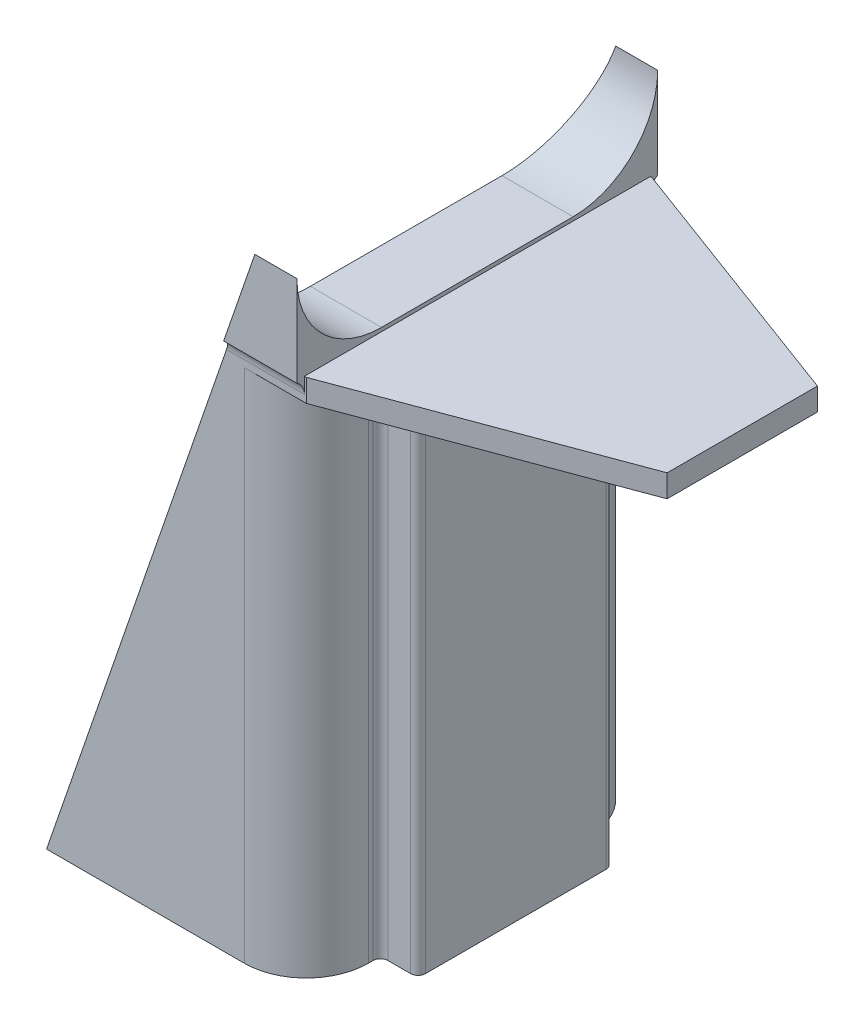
ISO-10303-21;
HEADER;
FILE_DESCRIPTION(('STEP AP214'),'2;1');
FILE_NAME('part.step','',(''),(''),'','','');
FILE_SCHEMA(('AUTOMOTIVE_DESIGN { 1 0 10303 214 1 1 1 1 }'));
ENDSEC;
DATA;
#1=APPLICATION_CONTEXT('core data for automotive mechanical design processes');
#2=APPLICATION_PROTOCOL_DEFINITION('international standard','automotive_design',2000,#1);
#3=PRODUCT_CONTEXT('',#1,'mechanical');
#4=PRODUCT('Part','Part','',(#3));
#5=PRODUCT_RELATED_PRODUCT_CATEGORY('part','',(#4));
#6=PRODUCT_DEFINITION_FORMATION('','',#4);
#7=PRODUCT_DEFINITION_CONTEXT('part definition',#1,'design');
#8=PRODUCT_DEFINITION('design','',#6,#7);
#9=PRODUCT_DEFINITION_SHAPE('','',#8);
#10=(LENGTH_UNIT() NAMED_UNIT(*) SI_UNIT(.MILLI.,.METRE.));
#11=(NAMED_UNIT(*) PLANE_ANGLE_UNIT() SI_UNIT($,.RADIAN.));
#12=(NAMED_UNIT(*) SI_UNIT($,.STERADIAN.) SOLID_ANGLE_UNIT());
#13=UNCERTAINTY_MEASURE_WITH_UNIT(LENGTH_MEASURE(1.E-05),#10,'distance_accuracy_value','');
#14=(GEOMETRIC_REPRESENTATION_CONTEXT(3) GLOBAL_UNCERTAINTY_ASSIGNED_CONTEXT((#13)) GLOBAL_UNIT_ASSIGNED_CONTEXT((#10,
#11,#12)) REPRESENTATION_CONTEXT('',''));
#15=CARTESIAN_POINT('',(0.,0.,0.));
#16=DIRECTION('',(0.,0.,1.));
#17=DIRECTION('',(1.,0.,0.));
#18=AXIS2_PLACEMENT_3D('',#15,#16,#17);
#19=CARTESIAN_POINT('',(0.,60.,-46.0000000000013));
#20=DIRECTION('',(0.,0.,-1.));
#21=DIRECTION('',(-1.,0.,0.));
#22=AXIS2_PLACEMENT_3D('',#19,#20,#21);
#23=PLANE('',#22);
#24=DIRECTION('',(-0.32556815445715,-0.945518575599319,0.));
#25=VECTOR('',#24,1.);
#26=CARTESIAN_POINT('',(30.5350630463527,49.4859346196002,-46.0000000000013));
#27=LINE('',#26,#25);
#28=CARTESIAN_POINT('',(34.7773205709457,61.8063450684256,-46.0000000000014));
#29=VERTEX_POINT('',#28);
#30=CARTESIAN_POINT('',(-13.1073829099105,-77.2609316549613,-46.0000000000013));
#31=VERTEX_POINT('',#30);
#32=EDGE_CURVE('E57',#29,#31,#27,.T.);
#33=ORIENTED_EDGE('',*,*,#32,.F.);
#34=DIRECTION('',(-1.,0.,0.));
#35=VECTOR('',#34,1.);
#36=CARTESIAN_POINT('',(55.4999999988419,61.8063450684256,-46.0000000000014));
#37=LINE('',#36,#35);
#38=CARTESIAN_POINT('',(55.4999999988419,61.8063450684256,-46.0000000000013));
#39=VERTEX_POINT('',#38);
#40=EDGE_CURVE('E336',#39,#29,#37,.T.);
#41=ORIENTED_EDGE('',*,*,#40,.F.);
#42=DIRECTION('',(0.,1.,0.));
#43=VECTOR('',#42,1.);
#44=CARTESIAN_POINT('',(55.4999999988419,61.8063450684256,-46.0000000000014));
#45=LINE('',#44,#43);
#46=CARTESIAN_POINT('',(55.4999999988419,66.,-46.0000000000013));
#47=VERTEX_POINT('',#46);
#48=EDGE_CURVE('E916',#39,#47,#45,.T.);
#49=ORIENTED_EDGE('',*,*,#48,.T.);
#50=DIRECTION('',(-1.,0.,0.));
#51=VECTOR('',#50,1.);
#52=CARTESIAN_POINT('',(0.,66.,-46.0000000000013));
#53=LINE('',#52,#51);
#54=CARTESIAN_POINT('',(55.9999999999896,66.,-46.0000000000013));
#55=VERTEX_POINT('',#54);
#56=EDGE_CURVE('E365',#55,#47,#53,.T.);
#57=ORIENTED_EDGE('',*,*,#56,.F.);
#58=DIRECTION('',(0.,-1.,0.));
#59=VECTOR('',#58,1.);
#60=CARTESIAN_POINT('',(55.9999999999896,66.,-46.0000000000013));
#61=LINE('',#60,#59);
#62=CARTESIAN_POINT('',(55.9999999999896,60.,-46.0000000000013));
#63=VERTEX_POINT('',#62);
#64=EDGE_CURVE('E408',#55,#63,#61,.T.);
#65=ORIENTED_EDGE('',*,*,#64,.T.);
#66=DIRECTION('',(-1.,0.,0.));
#67=VECTOR('',#66,1.);
#68=CARTESIAN_POINT('',(0.,60.,-46.0000000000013));
#69=LINE('',#68,#67);
#70=CARTESIAN_POINT('',(39.5138807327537,60.,-46.0000000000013));
#71=VERTEX_POINT('',#70);
#72=EDGE_CURVE('E385',#63,#71,#69,.T.);
#73=ORIENTED_EDGE('',*,*,#72,.T.);
#74=DIRECTION('',(0.,-1.,0.));
#75=VECTOR('',#74,1.);
#76=CARTESIAN_POINT('',(39.5138807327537,60.,-46.0000000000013));
#77=LINE('',#76,#75);
#78=CARTESIAN_POINT('',(39.5138807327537,-77.2609316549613,-46.0000000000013));
#79=VERTEX_POINT('',#78);
#80=EDGE_CURVE('E544',#71,#79,#77,.T.);
#81=ORIENTED_EDGE('',*,*,#80,.T.);
#82=DIRECTION('',(1.,0.,0.));
#83=VECTOR('',#82,1.);
#84=CARTESIAN_POINT('',(0.,-77.2609316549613,-46.0000000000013));
#85=LINE('',#84,#83);
#86=EDGE_CURVE('E797',#31,#79,#85,.T.);
#87=ORIENTED_EDGE('',*,*,#86,.F.);
#88=EDGE_LOOP('',(#33,#41,#49,#57,#65,#73,#81,#87));
#89=FACE_BOUND('',#88,.T.);
#90=ADVANCED_FACE('F41',(#89),#23,.T.);
#91=CARTESIAN_POINT('',(0.,60.,-40.0000000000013));
#92=DIRECTION('',(0.,0.,-1.));
#93=DIRECTION('',(-1.,0.,0.));
#94=AXIS2_PLACEMENT_3D('',#91,#92,#93);
#95=PLANE('',#94);
#96=DIRECTION('',(1.,0.,0.));
#97=VECTOR('',#96,1.);
#98=CARTESIAN_POINT('',(0.,60.,-40.0000000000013));
#99=LINE('',#98,#97);
#100=CARTESIAN_POINT('',(34.1553460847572,60.,-40.0000000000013));
#101=VERTEX_POINT('',#100);
#102=CARTESIAN_POINT('',(39.5138807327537,60.,-40.0000000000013));
#103=VERTEX_POINT('',#102);
#104=EDGE_CURVE('E431',#101,#103,#99,.T.);
#105=ORIENTED_EDGE('',*,*,#104,.F.);
#106=DIRECTION('',(-0.32556815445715,-0.945518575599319,0.));
#107=VECTOR('',#106,1.);
#108=CARTESIAN_POINT('',(30.5350630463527,49.4859346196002,-40.0000000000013));
#109=LINE('',#108,#107);
#110=CARTESIAN_POINT('',(-13.1073829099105,-77.2609316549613,-40.0000000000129));
#111=VERTEX_POINT('',#110);
#112=EDGE_CURVE('E759',#101,#111,#109,.T.);
#113=ORIENTED_EDGE('',*,*,#112,.T.);
#114=DIRECTION('',(1.,0.,0.));
#115=VECTOR('',#114,1.);
#116=CARTESIAN_POINT('',(0.,-77.2609316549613,-40.0000000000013));
#117=LINE('',#116,#115);
#118=CARTESIAN_POINT('',(39.5138807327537,-77.2609316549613,-40.0000000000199));
#119=VERTEX_POINT('',#118);
#120=EDGE_CURVE('E609',#111,#119,#117,.T.);
#121=ORIENTED_EDGE('',*,*,#120,.T.);
#122=DIRECTION('',(0.,-1.,0.));
#123=VECTOR('',#122,1.);
#124=CARTESIAN_POINT('',(39.5138807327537,60.,-40.0000000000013));
#125=LINE('',#124,#123);
#126=EDGE_CURVE('E540',#103,#119,#125,.T.);
#127=ORIENTED_EDGE('',*,*,#126,.F.);
#128=EDGE_LOOP('',(#105,#113,#121,#127));
#129=FACE_BOUND('',#128,.T.);
#130=ADVANCED_FACE('F723',(#129),#95,.F.);
#131=CARTESIAN_POINT('',(0.,60.,39.9999999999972));
#132=DIRECTION('',(0.,0.,1.));
#133=DIRECTION('',(1.,0.,0.));
#134=AXIS2_PLACEMENT_3D('',#131,#132,#133);
#135=PLANE('',#134);
#136=DIRECTION('',(-1.,0.,0.));
#137=VECTOR('',#136,1.);
#138=CARTESIAN_POINT('',(0.,-77.2609316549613,39.9999999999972));
#139=LINE('',#138,#137);
#140=CARTESIAN_POINT('',(39.4999999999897,-77.2609316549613,40.0000000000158));
#141=VERTEX_POINT('',#140);
#142=CARTESIAN_POINT('',(-13.1073829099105,-77.2609316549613,40.0000000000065));
#143=VERTEX_POINT('',#142);
#144=EDGE_CURVE('E839',#141,#143,#139,.T.);
#145=ORIENTED_EDGE('',*,*,#144,.T.);
#146=DIRECTION('',(0.32556815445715,0.945518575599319,0.));
#147=VECTOR('',#146,1.);
#148=CARTESIAN_POINT('',(30.5350630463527,49.4859346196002,39.9999999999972));
#149=LINE('',#148,#147);
#150=CARTESIAN_POINT('',(34.1553460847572,60.,39.9999999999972));
#151=VERTEX_POINT('',#150);
#152=EDGE_CURVE('E767',#143,#151,#149,.T.);
#153=ORIENTED_EDGE('',*,*,#152,.T.);
#154=DIRECTION('',(-1.,0.,0.));
#155=VECTOR('',#154,1.);
#156=CARTESIAN_POINT('',(0.,60.,39.9999999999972));
#157=LINE('',#156,#155);
#158=CARTESIAN_POINT('',(39.4999999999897,60.,39.9999999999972));
#159=VERTEX_POINT('',#158);
#160=EDGE_CURVE('E456',#159,#151,#157,.T.);
#161=ORIENTED_EDGE('',*,*,#160,.F.);
#162=DIRECTION('',(0.,-1.,0.));
#163=VECTOR('',#162,1.);
#164=CARTESIAN_POINT('',(39.4999999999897,60.,39.9999999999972));
#165=LINE('',#164,#163);
#166=EDGE_CURVE('E512',#159,#141,#165,.T.);
#167=ORIENTED_EDGE('',*,*,#166,.T.);
#168=EDGE_LOOP('',(#145,#153,#161,#167));
#169=FACE_BOUND('',#168,.T.);
#170=ADVANCED_FACE('F719',(#169),#135,.F.);
#171=CARTESIAN_POINT('',(0.,60.,45.9999999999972));
#172=DIRECTION('',(0.,0.,1.));
#173=DIRECTION('',(1.,0.,0.));
#174=AXIS2_PLACEMENT_3D('',#171,#172,#173);
#175=PLANE('',#174);
#176=DIRECTION('',(0.32556815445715,0.945518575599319,0.));
#177=VECTOR('',#176,1.);
#178=CARTESIAN_POINT('',(30.5350630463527,49.4859346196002,45.9999999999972));
#179=LINE('',#178,#177);
#180=CARTESIAN_POINT('',(-13.1073829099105,-77.2609316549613,46.0000000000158));
#181=VERTEX_POINT('',#180);
#182=CARTESIAN_POINT('',(34.7773205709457,61.8063450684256,45.9999999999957));
#183=VERTEX_POINT('',#182);
#184=EDGE_CURVE('E316',#181,#183,#179,.T.);
#185=ORIENTED_EDGE('',*,*,#184,.F.);
#186=DIRECTION('',(-1.,0.,0.));
#187=VECTOR('',#186,1.);
#188=CARTESIAN_POINT('',(-17.6073829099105,-77.2609316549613,45.9999999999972));
#189=LINE('',#188,#187);
#190=CARTESIAN_POINT('',(39.4999999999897,-77.2609316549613,45.9999999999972));
#191=VERTEX_POINT('',#190);
#192=EDGE_CURVE('E778',#191,#181,#189,.T.);
#193=ORIENTED_EDGE('',*,*,#192,.F.);
#194=DIRECTION('',(0.,-1.,0.));
#195=VECTOR('',#194,1.);
#196=CARTESIAN_POINT('',(39.4999999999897,60.,45.9999999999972));
#197=LINE('',#196,#195);
#198=CARTESIAN_POINT('',(39.4999999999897,60.,45.9999999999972));
#199=VERTEX_POINT('',#198);
#200=EDGE_CURVE('E508',#199,#191,#197,.T.);
#201=ORIENTED_EDGE('',*,*,#200,.F.);
#202=DIRECTION('',(1.,0.,0.));
#203=VECTOR('',#202,1.);
#204=CARTESIAN_POINT('',(0.,60.,45.9999999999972));
#205=LINE('',#204,#203);
#206=CARTESIAN_POINT('',(55.9999999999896,60.,45.9999999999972));
#207=VERTEX_POINT('',#206);
#208=EDGE_CURVE('E389',#199,#207,#205,.T.);
#209=ORIENTED_EDGE('',*,*,#208,.T.);
#210=DIRECTION('',(0.,-1.,0.));
#211=VECTOR('',#210,1.);
#212=CARTESIAN_POINT('',(55.9999999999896,66.,45.9999999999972));
#213=LINE('',#212,#211);
#214=CARTESIAN_POINT('',(55.9999999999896,66.,45.9999999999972));
#215=VERTEX_POINT('',#214);
#216=EDGE_CURVE('E404',#215,#207,#213,.T.);
#217=ORIENTED_EDGE('',*,*,#216,.F.);
#218=DIRECTION('',(1.,0.,0.));
#219=VECTOR('',#218,1.);
#220=CARTESIAN_POINT('',(0.,66.,45.9999999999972));
#221=LINE('',#220,#219);
#222=CARTESIAN_POINT('',(55.4999999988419,66.,45.9999999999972));
#223=VERTEX_POINT('',#222);
#224=EDGE_CURVE('E370',#223,#215,#221,.T.);
#225=ORIENTED_EDGE('',*,*,#224,.F.);
#226=DIRECTION('',(0.,-1.,0.));
#227=VECTOR('',#226,1.);
#228=CARTESIAN_POINT('',(55.499999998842,61.8063450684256,45.9999999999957));
#229=LINE('',#228,#227);
#230=CARTESIAN_POINT('',(55.499999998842,61.8063450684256,45.9999999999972));
#231=VERTEX_POINT('',#230);
#232=EDGE_CURVE('E923',#223,#231,#229,.T.);
#233=ORIENTED_EDGE('',*,*,#232,.T.);
#234=DIRECTION('',(-1.,0.,0.));
#235=VECTOR('',#234,1.);
#236=CARTESIAN_POINT('',(55.499999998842,61.8063450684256,45.9999999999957));
#237=LINE('',#236,#235);
#238=EDGE_CURVE('E329',#231,#183,#237,.T.);
#239=ORIENTED_EDGE('',*,*,#238,.T.);
#240=EDGE_LOOP('',(#185,#193,#201,#209,#217,#225,#233,#239));
#241=FACE_BOUND('',#240,.T.);
#242=ADVANCED_FACE('F675',(#241),#175,.T.);
#243=CARTESIAN_POINT('',(0.,66.,0.));
#244=DIRECTION('',(0.,1.,0.));
#245=DIRECTION('',(0.,0.,1.));
#246=AXIS2_PLACEMENT_3D('',#243,#244,#245);
#247=PLANE('',#246);
#248=ORIENTED_EDGE('',*,*,#56,.T.);
#249=DIRECTION('',(0.,0.,1.));
#250=VECTOR('',#249,1.);
#251=CARTESIAN_POINT('',(55.4999999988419,66.,-46.0000000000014));
#252=LINE('',#251,#250);
#253=EDGE_CURVE('E919',#47,#223,#252,.T.);
#254=ORIENTED_EDGE('',*,*,#253,.T.);
#255=ORIENTED_EDGE('',*,*,#224,.T.);
#256=DIRECTION('',(-0.937425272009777,0.,0.348186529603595));
#257=VECTOR('',#256,1.);
#258=CARTESIAN_POINT('',(21.8034433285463,66.,58.7015781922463));
#259=LINE('',#258,#257);
#260=CARTESIAN_POINT('',(125.99999999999,66.,20.));
#261=VERTEX_POINT('',#260);
#262=EDGE_CURVE('E373',#261,#215,#259,.T.);
#263=ORIENTED_EDGE('',*,*,#262,.F.);
#264=DIRECTION('',(0.,0.,1.));
#265=VECTOR('',#264,1.);
#266=CARTESIAN_POINT('',(125.99999999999,66.,0.));
#267=LINE('',#266,#265);
#268=CARTESIAN_POINT('',(125.99999999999,66.,-20.));
#269=VERTEX_POINT('',#268);
#270=EDGE_CURVE('E377',#269,#261,#267,.T.);
#271=ORIENTED_EDGE('',*,*,#270,.F.);
#272=DIRECTION('',(0.93742527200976,0.,0.348186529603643));
#273=VECTOR('',#272,1.);
#274=CARTESIAN_POINT('',(21.8034433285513,66.,-58.7015781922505));
#275=LINE('',#274,#273);
#276=EDGE_CURVE('E361',#55,#269,#275,.T.);
#277=ORIENTED_EDGE('',*,*,#276,.F.);
#278=EDGE_LOOP('',(#248,#254,#255,#263,#271,#277));
#279=FACE_BOUND('',#278,.T.);
#280=ADVANCED_FACE('F672',(#279),#247,.T.);
#281=CARTESIAN_POINT('',(63.9999999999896,60.,-23.730137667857));
#282=DIRECTION('',(0.,-1.,0.));
#283=DIRECTION('',(0.,0.,-1.));
#284=AXIS2_PLACEMENT_3D('',#281,#282,#283);
#285=CYLINDRICAL_SURFACE('',#284,2.);
#286=CARTESIAN_POINT('',(63.9999999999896,-77.2609316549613,-23.730137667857));
#287=DIRECTION('',(0.,1.,0.));
#288=DIRECTION('',(0.,0.,1.));
#289=AXIS2_PLACEMENT_3D('',#286,#287,#288);
#290=CIRCLE('',#289,2.);
#291=CARTESIAN_POINT('',(63.9999999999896,-77.2609316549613,-25.730137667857));
#292=VERTEX_POINT('',#291);
#293=CARTESIAN_POINT('',(65.9999999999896,-77.2609316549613,-23.730137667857));
#294=VERTEX_POINT('',#293);
#295=EDGE_CURVE('E794',#292,#294,#290,.F.);
#296=ORIENTED_EDGE('',*,*,#295,.F.);
#297=DIRECTION('',(0.,-1.,0.));
#298=VECTOR('',#297,1.);
#299=CARTESIAN_POINT('',(63.9999999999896,60.,-25.730137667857));
#300=LINE('',#299,#298);
#301=CARTESIAN_POINT('',(63.9999999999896,60.,-25.730137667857));
#302=VERTEX_POINT('',#301);
#303=EDGE_CURVE('E549',#302,#292,#300,.T.);
#304=ORIENTED_EDGE('',*,*,#303,.F.);
#305=CARTESIAN_POINT('',(63.9999999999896,60.,-23.730137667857));
#306=DIRECTION('',(0.,1.,0.));
#307=DIRECTION('',(0.,0.,1.));
#308=AXIS2_PLACEMENT_3D('',#305,#306,#307);
#309=CIRCLE('',#308,2.);
#310=CARTESIAN_POINT('',(65.9999999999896,60.,-23.730137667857));
#311=VERTEX_POINT('',#310);
#312=EDGE_CURVE('E412',#302,#311,#309,.F.);
#313=ORIENTED_EDGE('',*,*,#312,.T.);
#314=DIRECTION('',(0.,-1.,0.));
#315=VECTOR('',#314,1.);
#316=CARTESIAN_POINT('',(65.9999999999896,60.,-23.730137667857));
#317=LINE('',#316,#315);
#318=EDGE_CURVE('E484',#311,#294,#317,.T.);
#319=ORIENTED_EDGE('',*,*,#318,.T.);
#320=EDGE_LOOP('',(#296,#304,#313,#319));
#321=FACE_BOUND('',#320,.T.);
#322=ADVANCED_FACE('F43',(#321),#285,.T.);
#323=CARTESIAN_POINT('',(0.,60.,-25.730137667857));
#324=DIRECTION('',(0.,0.,-1.));
#325=DIRECTION('',(-1.,0.,0.));
#326=AXIS2_PLACEMENT_3D('',#323,#324,#325);
#327=PLANE('',#326);
#328=DIRECTION('',(1.,0.,0.));
#329=VECTOR('',#328,1.);
#330=CARTESIAN_POINT('',(0.,-77.2609316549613,-25.730137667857));
#331=LINE('',#330,#329);
#332=CARTESIAN_POINT('',(57.9999999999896,-77.2609316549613,-25.730137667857));
#333=VERTEX_POINT('',#332);
#334=EDGE_CURVE('E791',#333,#292,#331,.T.);
#335=ORIENTED_EDGE('',*,*,#334,.F.);
#336=DIRECTION('',(0.,-1.,0.));
#337=VECTOR('',#336,1.);
#338=CARTESIAN_POINT('',(57.9999999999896,60.,-25.730137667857));
#339=LINE('',#338,#337);
#340=CARTESIAN_POINT('',(57.9999999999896,60.,-25.730137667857));
#341=VERTEX_POINT('',#340);
#342=EDGE_CURVE('E545',#341,#333,#339,.T.);
#343=ORIENTED_EDGE('',*,*,#342,.F.);
#344=DIRECTION('',(1.,0.,0.));
#345=VECTOR('',#344,1.);
#346=CARTESIAN_POINT('',(0.,60.,-25.730137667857));
#347=LINE('',#346,#345);
#348=EDGE_CURVE('E416',#341,#302,#347,.T.);
#349=ORIENTED_EDGE('',*,*,#348,.T.);
#350=ORIENTED_EDGE('',*,*,#303,.T.);
#351=EDGE_LOOP('',(#335,#343,#349,#350));
#352=FACE_BOUND('',#351,.T.);
#353=ADVANCED_FACE('F861',(#352),#327,.T.);
#354=CARTESIAN_POINT('',(57.9999999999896,60.,-27.730137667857));
#355=DIRECTION('',(0.,-1.,0.));
#356=DIRECTION('',(0.,0.,-1.));
#357=AXIS2_PLACEMENT_3D('',#354,#355,#356);
#358=CYLINDRICAL_SURFACE('',#357,2.);
#359=ORIENTED_EDGE('',*,*,#342,.T.);
#360=CARTESIAN_POINT('',(57.9999999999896,-77.2609316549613,-27.730137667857));
#361=DIRECTION('',(0.,1.,0.));
#362=DIRECTION('',(0.,0.,1.));
#363=AXIS2_PLACEMENT_3D('',#360,#361,#362);
#364=CIRCLE('',#363,2.);
#365=CARTESIAN_POINT('',(55.9999999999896,-77.2609316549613,-27.730137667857));
#366=VERTEX_POINT('',#365);
#367=EDGE_CURVE('E787',#333,#366,#364,.F.);
#368=ORIENTED_EDGE('',*,*,#367,.T.);
#369=DIRECTION('',(0.,1.,0.));
#370=VECTOR('',#369,1.);
#371=CARTESIAN_POINT('',(55.9999999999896,-106.902939,-27.730137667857));
#372=LINE('',#371,#370);
#373=CARTESIAN_POINT('',(55.9999999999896,0.,-27.730137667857));
#374=VERTEX_POINT('',#373);
#375=EDGE_CURVE('E604',#366,#374,#372,.T.);
#376=ORIENTED_EDGE('',*,*,#375,.T.);
#377=DIRECTION('',(0.,-1.,0.));
#378=VECTOR('',#377,1.);
#379=CARTESIAN_POINT('',(55.9999999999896,60.,-27.730137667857));
#380=LINE('',#379,#378);
#381=CARTESIAN_POINT('',(55.9999999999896,60.,-27.730137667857));
#382=VERTEX_POINT('',#381);
#383=EDGE_CURVE('E550',#382,#374,#380,.T.);
#384=ORIENTED_EDGE('',*,*,#383,.F.);
#385=CARTESIAN_POINT('',(57.9999999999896,60.,-27.730137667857));
#386=DIRECTION('',(0.,1.,0.));
#387=DIRECTION('',(0.,0.,1.));
#388=AXIS2_PLACEMENT_3D('',#385,#386,#387);
#389=CIRCLE('',#388,2.);
#390=EDGE_CURVE('E421',#341,#382,#389,.F.);
#391=ORIENTED_EDGE('',*,*,#390,.F.);
#392=EDGE_LOOP('',(#359,#368,#376,#384,#391));
#393=FACE_BOUND('',#392,.T.);
#394=ADVANCED_FACE('F585',(#393),#358,.F.);
#395=CARTESIAN_POINT('',(55.9999999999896,60.,0.));
#396=DIRECTION('',(1.,0.,0.));
#397=DIRECTION('',(0.,0.,-1.));
#398=AXIS2_PLACEMENT_3D('',#395,#396,#397);
#399=PLANE('',#398);
#400=CARTESIAN_POINT('',(56.0085732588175,0.,-28.8232707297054));
#401=DIRECTION('',(-0.00784259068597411,0.,0.999969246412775));
#402=VECTOR('',#401,1.);
#403=LINE('',#400,#402);
#404=CARTESIAN_POINT('',(56.0042866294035,0.,-28.8233043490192));
#405=VERTEX_POINT('',#404);
#406=EDGE_CURVE('E411',#405,#374,#403,.T.);
#407=ORIENTED_EDGE('',*,*,#406,.F.);
#408=DIRECTION('',(0.,-1.,0.));
#409=VECTOR('',#408,1.);
#410=CARTESIAN_POINT('',(55.9999999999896,60.,-28.8233379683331));
#411=LINE('',#410,#409);
#412=CARTESIAN_POINT('',(55.9999999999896,60.,-28.8233379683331));
#413=VERTEX_POINT('',#412);
#414=EDGE_CURVE('E567',#413,#405,#411,.T.);
#415=ORIENTED_EDGE('',*,*,#414,.F.);
#416=DIRECTION('',(0.,0.,1.));
#417=VECTOR('',#416,1.);
#418=CARTESIAN_POINT('',(55.9999999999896,60.,0.));
#419=LINE('',#418,#417);
#420=EDGE_CURVE('E424',#413,#382,#419,.T.);
#421=ORIENTED_EDGE('',*,*,#420,.T.);
#422=ORIENTED_EDGE('',*,*,#383,.T.);
#423=EDGE_LOOP('',(#407,#415,#421,#422));
#424=FACE_BOUND('',#423,.T.);
#425=ADVANCED_FACE('F580',(#424),#399,.T.);
#426=CARTESIAN_POINT('',(39.5138807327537,60.,-29.5000000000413));
#427=DIRECTION('',(0.,-1.,0.));
#428=DIRECTION('',(0.,0.,-1.));
#429=AXIS2_PLACEMENT_3D('',#426,#427,#428);
#430=CYLINDRICAL_SURFACE('',#429,16.4999999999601);
#431=DIRECTION('',(0.,1.,0.));
#432=VECTOR('',#431,1.);
#433=CARTESIAN_POINT('',(56.0138807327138,-106.902939,-29.5000000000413));
#434=LINE('',#433,#432);
#435=CARTESIAN_POINT('',(56.0138807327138,-77.2609316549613,-29.5000000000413));
#436=VERTEX_POINT('',#435);
#437=CARTESIAN_POINT('',(56.0141086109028,0.,-29.4999994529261));
#438=VERTEX_POINT('',#437);
#439=EDGE_CURVE('E608',#436,#438,#434,.T.);
#440=ORIENTED_EDGE('',*,*,#439,.F.);
#441=CARTESIAN_POINT('',(39.5138807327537,-77.2609316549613,-29.5000000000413));
#442=DIRECTION('',(0.,1.,0.));
#443=DIRECTION('',(0.,0.,1.));
#444=AXIS2_PLACEMENT_3D('',#441,#442,#443);
#445=CIRCLE('',#444,16.4999999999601);
#446=EDGE_CURVE('E65',#436,#79,#445,.T.);
#447=ORIENTED_EDGE('',*,*,#446,.T.);
#448=ORIENTED_EDGE('',*,*,#80,.F.);
#449=CARTESIAN_POINT('',(39.5138807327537,60.,-29.5000000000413));
#450=DIRECTION('',(0.,1.,0.));
#451=DIRECTION('',(0.,0.,1.));
#452=AXIS2_PLACEMENT_3D('',#449,#450,#451);
#453=CIRCLE('',#452,16.4999999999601);
#454=EDGE_CURVE('E428',#413,#71,#453,.T.);
#455=ORIENTED_EDGE('',*,*,#454,.F.);
#456=ORIENTED_EDGE('',*,*,#414,.T.);
#457=CARTESIAN_POINT('',(39.5138807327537,0.,-29.5000000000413));
#458=DIRECTION('',(0.,1.,0.));
#459=DIRECTION('',(0.999158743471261,0.,0.0410098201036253));
#460=AXIS2_PLACEMENT_3D('',#457,#458,#459);
#461=CIRCLE('',#460,16.4999999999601);
#462=EDGE_CURVE('E417',#405,#438,#461,.T.);
#463=ORIENTED_EDGE('',*,*,#462,.T.);
#464=EDGE_LOOP('',(#440,#447,#448,#455,#456,#463));
#465=FACE_BOUND('',#464,.T.);
#466=ADVANCED_FACE('F569',(#465),#430,.T.);
#467=CARTESIAN_POINT('',(39.5138807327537,60.,-29.5000000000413));
#468=DIRECTION('',(0.,-1.,0.));
#469=DIRECTION('',(0.,0.,-1.));
#470=AXIS2_PLACEMENT_3D('',#467,#468,#469);
#471=CYLINDRICAL_SURFACE('',#470,10.4999999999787);
#472=CARTESIAN_POINT('',(39.5138807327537,-77.2609316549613,-29.5000000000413));
#473=DIRECTION('',(0.,1.,0.));
#474=DIRECTION('',(0.,0.,1.));
#475=AXIS2_PLACEMENT_3D('',#472,#473,#474);
#476=CIRCLE('',#475,10.4999999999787);
#477=CARTESIAN_POINT('',(49.9999999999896,-77.2609316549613,-28.9602753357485));
#478=VERTEX_POINT('',#477);
#479=EDGE_CURVE('E835',#478,#119,#476,.T.);
#480=ORIENTED_EDGE('',*,*,#479,.F.);
#481=DIRECTION('',(0.,-1.,0.));
#482=VECTOR('',#481,1.);
#483=CARTESIAN_POINT('',(49.9999999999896,60.,-28.9602753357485));
#484=LINE('',#483,#482);
#485=CARTESIAN_POINT('',(49.9999999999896,60.,-28.9602753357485));
#486=VERTEX_POINT('',#485);
#487=EDGE_CURVE('E536',#486,#478,#484,.T.);
#488=ORIENTED_EDGE('',*,*,#487,.F.);
#489=CARTESIAN_POINT('',(39.5138807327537,60.,-29.5000000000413));
#490=DIRECTION('',(0.,1.,0.));
#491=DIRECTION('',(0.,0.,1.));
#492=AXIS2_PLACEMENT_3D('',#489,#490,#491);
#493=CIRCLE('',#492,10.4999999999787);
#494=EDGE_CURVE('E434',#486,#103,#493,.T.);
#495=ORIENTED_EDGE('',*,*,#494,.T.);
#496=ORIENTED_EDGE('',*,*,#126,.T.);
#497=EDGE_LOOP('',(#480,#488,#495,#496));
#498=FACE_BOUND('',#497,.T.);
#499=ADVANCED_FACE('F579',(#498),#471,.F.);
#500=CARTESIAN_POINT('',(49.9999999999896,60.,0.));
#501=DIRECTION('',(-1.,0.,0.));
#502=DIRECTION('',(0.,0.,1.));
#503=AXIS2_PLACEMENT_3D('',#500,#501,#502);
#504=PLANE('',#503);
#505=DIRECTION('',(0.,0.,-1.));
#506=VECTOR('',#505,1.);
#507=CARTESIAN_POINT('',(49.9999999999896,-77.2609316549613,0.));
#508=LINE('',#507,#506);
#509=CARTESIAN_POINT('',(49.9999999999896,-77.2609316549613,-19.730137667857));
#510=VERTEX_POINT('',#509);
#511=EDGE_CURVE('E832',#510,#478,#508,.T.);
#512=ORIENTED_EDGE('',*,*,#511,.F.);
#513=DIRECTION('',(0.,-1.,0.));
#514=VECTOR('',#513,1.);
#515=CARTESIAN_POINT('',(49.9999999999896,60.,-19.730137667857));
#516=LINE('',#515,#514);
#517=CARTESIAN_POINT('',(49.9999999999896,60.,-19.730137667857));
#518=VERTEX_POINT('',#517);
#519=EDGE_CURVE('E532',#518,#510,#516,.T.);
#520=ORIENTED_EDGE('',*,*,#519,.F.);
#521=DIRECTION('',(0.,0.,-1.));
#522=VECTOR('',#521,1.);
#523=CARTESIAN_POINT('',(49.9999999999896,60.,0.));
#524=LINE('',#523,#522);
#525=EDGE_CURVE('E438',#518,#486,#524,.T.);
#526=ORIENTED_EDGE('',*,*,#525,.T.);
#527=ORIENTED_EDGE('',*,*,#487,.T.);
#528=EDGE_LOOP('',(#512,#520,#526,#527));
#529=FACE_BOUND('',#528,.T.);
#530=ADVANCED_FACE('F743',(#529),#504,.T.);
#531=CARTESIAN_POINT('',(0.,60.,-19.730137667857));
#532=DIRECTION('',(0.,0.,1.));
#533=DIRECTION('',(1.,0.,0.));
#534=AXIS2_PLACEMENT_3D('',#531,#532,#533);
#535=PLANE('',#534);
#536=DIRECTION('',(-1.,0.,0.));
#537=VECTOR('',#536,1.);
#538=CARTESIAN_POINT('',(0.,-77.2609316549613,-19.730137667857));
#539=LINE('',#538,#537);
#540=CARTESIAN_POINT('',(59.9999999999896,-77.2609316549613,-19.730137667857));
#541=VERTEX_POINT('',#540);
#542=EDGE_CURVE('E829',#541,#510,#539,.T.);
#543=ORIENTED_EDGE('',*,*,#542,.F.);
#544=DIRECTION('',(0.,-1.,0.));
#545=VECTOR('',#544,1.);
#546=CARTESIAN_POINT('',(59.9999999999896,60.,-19.730137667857));
#547=LINE('',#546,#545);
#548=CARTESIAN_POINT('',(59.9999999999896,50.,-19.730137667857));
#549=VERTEX_POINT('',#548);
#550=EDGE_CURVE('E528',#549,#541,#547,.T.);
#551=ORIENTED_EDGE('',*,*,#550,.F.);
#552=DIRECTION('',(-1.,0.,0.));
#553=VECTOR('',#552,1.);
#554=CARTESIAN_POINT('',(125.99999999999,50.,-19.730137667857));
#555=LINE('',#554,#553);
#556=CARTESIAN_POINT('',(65.9999999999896,50.,-19.730137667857));
#557=VERTEX_POINT('',#556);
#558=EDGE_CURVE('E345',#557,#549,#555,.T.);
#559=ORIENTED_EDGE('',*,*,#558,.F.);
#560=DIRECTION('',(0.,1.,0.));
#561=VECTOR('',#560,1.);
#562=CARTESIAN_POINT('',(65.9999999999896,60.,-19.730137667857));
#563=LINE('',#562,#561);
#564=CARTESIAN_POINT('',(65.9999999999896,60.,-19.730137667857));
#565=VERTEX_POINT('',#564);
#566=EDGE_CURVE('E356',#557,#565,#563,.T.);
#567=ORIENTED_EDGE('',*,*,#566,.T.);
#568=DIRECTION('',(-1.,0.,0.));
#569=VECTOR('',#568,1.);
#570=CARTESIAN_POINT('',(0.,60.,-19.730137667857));
#571=LINE('',#570,#569);
#572=EDGE_CURVE('E442',#565,#518,#571,.T.);
#573=ORIENTED_EDGE('',*,*,#572,.T.);
#574=ORIENTED_EDGE('',*,*,#519,.T.);
#575=EDGE_LOOP('',(#543,#551,#559,#567,#573,#574));
#576=FACE_BOUND('',#575,.T.);
#577=ADVANCED_FACE('F739',(#576),#535,.T.);
#578=CARTESIAN_POINT('',(59.9999999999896,60.,0.));
#579=DIRECTION('',(-1.,0.,0.));
#580=DIRECTION('',(0.,0.,1.));
#581=AXIS2_PLACEMENT_3D('',#578,#579,#580);
#582=PLANE('',#581);
#583=DIRECTION('',(0.,0.,-1.));
#584=VECTOR('',#583,1.);
#585=CARTESIAN_POINT('',(59.9999999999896,-77.2609316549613,0.));
#586=LINE('',#585,#584);
#587=CARTESIAN_POINT('',(59.9999999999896,-77.2609316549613,20.269862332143));
#588=VERTEX_POINT('',#587);
#589=EDGE_CURVE('E826',#588,#541,#586,.T.);
#590=ORIENTED_EDGE('',*,*,#589,.F.);
#591=DIRECTION('',(0.,-1.,0.));
#592=VECTOR('',#591,1.);
#593=CARTESIAN_POINT('',(59.9999999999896,60.,20.269862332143));
#594=LINE('',#593,#592);
#595=CARTESIAN_POINT('',(59.9999999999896,50.,20.269862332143));
#596=VERTEX_POINT('',#595);
#597=EDGE_CURVE('E524',#596,#588,#594,.T.);
#598=ORIENTED_EDGE('',*,*,#597,.F.);
#599=DIRECTION('',(0.,0.,1.));
#600=VECTOR('',#599,1.);
#601=CARTESIAN_POINT('',(59.9999999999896,50.,-19.730137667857));
#602=LINE('',#601,#600);
#603=EDGE_CURVE('E341',#549,#596,#602,.T.);
#604=ORIENTED_EDGE('',*,*,#603,.F.);
#605=ORIENTED_EDGE('',*,*,#550,.T.);
#606=EDGE_LOOP('',(#590,#598,#604,#605));
#607=FACE_BOUND('',#606,.T.);
#608=ADVANCED_FACE('F735',(#607),#582,.T.);
#609=CARTESIAN_POINT('',(0.,60.,20.269862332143));
#610=DIRECTION('',(0.,0.,-1.));
#611=DIRECTION('',(-1.,0.,0.));
#612=AXIS2_PLACEMENT_3D('',#609,#610,#611);
#613=PLANE('',#612);
#614=DIRECTION('',(1.,0.,0.));
#615=VECTOR('',#614,1.);
#616=CARTESIAN_POINT('',(0.,-77.2609316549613,20.269862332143));
#617=LINE('',#616,#615);
#618=CARTESIAN_POINT('',(49.9999999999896,-77.2609316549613,20.269862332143));
#619=VERTEX_POINT('',#618);
#620=EDGE_CURVE('E823',#619,#588,#617,.T.);
#621=ORIENTED_EDGE('',*,*,#620,.F.);
#622=DIRECTION('',(0.,-1.,0.));
#623=VECTOR('',#622,1.);
#624=CARTESIAN_POINT('',(49.9999999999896,60.,20.269862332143));
#625=LINE('',#624,#623);
#626=CARTESIAN_POINT('',(49.9999999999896,60.,20.269862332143));
#627=VERTEX_POINT('',#626);
#628=EDGE_CURVE('E520',#627,#619,#625,.T.);
#629=ORIENTED_EDGE('',*,*,#628,.F.);
#630=DIRECTION('',(1.,0.,0.));
#631=VECTOR('',#630,1.);
#632=CARTESIAN_POINT('',(0.,60.,20.269862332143));
#633=LINE('',#632,#631);
#634=CARTESIAN_POINT('',(65.9999999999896,60.,20.269862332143));
#635=VERTEX_POINT('',#634);
#636=EDGE_CURVE('E446',#627,#635,#633,.T.);
#637=ORIENTED_EDGE('',*,*,#636,.T.);
#638=DIRECTION('',(0.,-1.,0.));
#639=VECTOR('',#638,1.);
#640=CARTESIAN_POINT('',(65.9999999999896,60.,20.269862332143));
#641=LINE('',#640,#639);
#642=CARTESIAN_POINT('',(65.9999999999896,50.,20.269862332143));
#643=VERTEX_POINT('',#642);
#644=EDGE_CURVE('E350',#635,#643,#641,.T.);
#645=ORIENTED_EDGE('',*,*,#644,.T.);
#646=DIRECTION('',(-1.,0.,0.));
#647=VECTOR('',#646,1.);
#648=CARTESIAN_POINT('',(125.99999999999,50.,20.269862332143));
#649=LINE('',#648,#647);
#650=EDGE_CURVE('E347',#643,#596,#649,.T.);
#651=ORIENTED_EDGE('',*,*,#650,.T.);
#652=ORIENTED_EDGE('',*,*,#597,.T.);
#653=EDGE_LOOP('',(#621,#629,#637,#645,#651,#652));
#654=FACE_BOUND('',#653,.T.);
#655=ADVANCED_FACE('F731',(#654),#613,.T.);
#656=CARTESIAN_POINT('',(49.9999999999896,60.,0.));
#657=DIRECTION('',(-1.,0.,0.));
#658=DIRECTION('',(0.,0.,1.));
#659=AXIS2_PLACEMENT_3D('',#656,#657,#658);
#660=PLANE('',#659);
#661=DIRECTION('',(0.,0.,-1.));
#662=VECTOR('',#661,1.);
#663=CARTESIAN_POINT('',(49.9999999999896,-77.2609316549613,0.));
#664=LINE('',#663,#662);
#665=CARTESIAN_POINT('',(49.9999999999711,-77.2609316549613,29.5000000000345));
#666=VERTEX_POINT('',#665);
#667=EDGE_CURVE('E820',#666,#619,#664,.T.);
#668=ORIENTED_EDGE('',*,*,#667,.F.);
#669=DIRECTION('',(0.,-1.,0.));
#670=VECTOR('',#669,1.);
#671=CARTESIAN_POINT('',(49.9999999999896,60.,29.5000000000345));
#672=LINE('',#671,#670);
#673=CARTESIAN_POINT('',(49.9999999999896,60.,29.5000000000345));
#674=VERTEX_POINT('',#673);
#675=EDGE_CURVE('E516',#674,#666,#672,.T.);
#676=ORIENTED_EDGE('',*,*,#675,.F.);
#677=DIRECTION('',(0.,0.,-1.));
#678=VECTOR('',#677,1.);
#679=CARTESIAN_POINT('',(49.9999999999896,60.,0.));
#680=LINE('',#679,#678);
#681=EDGE_CURVE('E449',#674,#627,#680,.T.);
#682=ORIENTED_EDGE('',*,*,#681,.T.);
#683=ORIENTED_EDGE('',*,*,#628,.T.);
#684=EDGE_LOOP('',(#668,#676,#682,#683));
#685=FACE_BOUND('',#684,.T.);
#686=ADVANCED_FACE('F727',(#685),#660,.T.);
#687=CARTESIAN_POINT('',(39.4999999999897,60.,29.5000000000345));
#688=DIRECTION('',(0.,-1.,0.));
#689=DIRECTION('',(0.,0.,-1.));
#690=AXIS2_PLACEMENT_3D('',#687,#688,#689);
#691=CYLINDRICAL_SURFACE('',#690,10.4999999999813);
#692=ORIENTED_EDGE('',*,*,#675,.T.);
#693=CARTESIAN_POINT('',(39.4999999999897,-77.2609316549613,29.5000000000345));
#694=DIRECTION('',(0.,1.,0.));
#695=DIRECTION('',(0.,0.,1.));
#696=AXIS2_PLACEMENT_3D('',#693,#694,#695);
#697=CIRCLE('',#696,10.4999999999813);
#698=EDGE_CURVE('E816',#666,#141,#697,.F.);
#699=ORIENTED_EDGE('',*,*,#698,.T.);
#700=ORIENTED_EDGE('',*,*,#166,.F.);
#701=CARTESIAN_POINT('',(39.4999999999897,60.,29.5000000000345));
#702=DIRECTION('',(0.,1.,0.));
#703=DIRECTION('',(0.,0.,1.));
#704=AXIS2_PLACEMENT_3D('',#701,#702,#703);
#705=CIRCLE('',#704,10.4999999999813);
#706=EDGE_CURVE('E453',#674,#159,#705,.F.);
#707=ORIENTED_EDGE('',*,*,#706,.F.);
#708=EDGE_LOOP('',(#692,#699,#700,#707));
#709=FACE_BOUND('',#708,.T.);
#710=ADVANCED_FACE('F715',(#709),#691,.F.);
#711=CARTESIAN_POINT('',(39.4999999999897,60.,29.5000000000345));
#712=DIRECTION('',(0.,-1.,0.));
#713=DIRECTION('',(0.,0.,-1.));
#714=AXIS2_PLACEMENT_3D('',#711,#712,#713);
#715=CYLINDRICAL_SURFACE('',#714,16.4999999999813);
#716=ORIENTED_EDGE('',*,*,#200,.T.);
#717=CARTESIAN_POINT('',(39.4999999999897,-77.2609316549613,29.5000000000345));
#718=DIRECTION('',(0.,1.,0.));
#719=DIRECTION('',(0.,0.,1.));
#720=AXIS2_PLACEMENT_3D('',#717,#718,#719);
#721=CIRCLE('',#720,16.4999999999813);
#722=CARTESIAN_POINT('',(55.9999999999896,-77.2609316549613,29.5000000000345));
#723=VERTEX_POINT('',#722);
#724=EDGE_CURVE('E812',#191,#723,#721,.T.);
#725=ORIENTED_EDGE('',*,*,#724,.T.);
#726=DIRECTION('',(0.,-1.,0.));
#727=VECTOR('',#726,1.);
#728=CARTESIAN_POINT('',(55.9999999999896,60.,29.5000000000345));
#729=LINE('',#728,#727);
#730=CARTESIAN_POINT('',(55.9999999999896,60.,29.5000000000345));
#731=VERTEX_POINT('',#730);
#732=EDGE_CURVE('E504',#731,#723,#729,.T.);
#733=ORIENTED_EDGE('',*,*,#732,.F.);
#734=CARTESIAN_POINT('',(39.4999999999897,60.,29.5000000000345));
#735=DIRECTION('',(0.,1.,0.));
#736=DIRECTION('',(0.,0.,1.));
#737=AXIS2_PLACEMENT_3D('',#734,#735,#736);
#738=CIRCLE('',#737,16.4999999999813);
#739=EDGE_CURVE('E460',#199,#731,#738,.T.);
#740=ORIENTED_EDGE('',*,*,#739,.F.);
#741=EDGE_LOOP('',(#716,#725,#733,#740));
#742=FACE_BOUND('',#741,.T.);
#743=ADVANCED_FACE('F711',(#742),#715,.T.);
#744=CARTESIAN_POINT('',(55.9999999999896,60.,0.));
#745=DIRECTION('',(1.,0.,0.));
#746=DIRECTION('',(0.,0.,-1.));
#747=AXIS2_PLACEMENT_3D('',#744,#745,#746);
#748=PLANE('',#747);
#749=DIRECTION('',(0.,0.,1.));
#750=VECTOR('',#749,1.);
#751=CARTESIAN_POINT('',(55.9999999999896,-77.2609316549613,0.));
#752=LINE('',#751,#750);
#753=CARTESIAN_POINT('',(55.9999999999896,-77.2609316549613,28.269862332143));
#754=VERTEX_POINT('',#753);
#755=EDGE_CURVE('E809',#754,#723,#752,.T.);
#756=ORIENTED_EDGE('',*,*,#755,.F.);
#757=DIRECTION('',(0.,-1.,0.));
#758=VECTOR('',#757,1.);
#759=CARTESIAN_POINT('',(55.9999999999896,60.,28.269862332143));
#760=LINE('',#759,#758);
#761=CARTESIAN_POINT('',(55.9999999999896,60.,28.269862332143));
#762=VERTEX_POINT('',#761);
#763=EDGE_CURVE('E500',#762,#754,#760,.T.);
#764=ORIENTED_EDGE('',*,*,#763,.F.);
#765=DIRECTION('',(0.,0.,1.));
#766=VECTOR('',#765,1.);
#767=CARTESIAN_POINT('',(55.9999999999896,60.,0.));
#768=LINE('',#767,#766);
#769=EDGE_CURVE('E463',#762,#731,#768,.T.);
#770=ORIENTED_EDGE('',*,*,#769,.T.);
#771=ORIENTED_EDGE('',*,*,#732,.T.);
#772=EDGE_LOOP('',(#756,#764,#770,#771));
#773=FACE_BOUND('',#772,.T.);
#774=ADVANCED_FACE('F707',(#773),#748,.T.);
#775=CARTESIAN_POINT('',(57.9999999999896,60.,28.269862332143));
#776=DIRECTION('',(0.,-1.,0.));
#777=DIRECTION('',(0.,0.,-1.));
#778=AXIS2_PLACEMENT_3D('',#775,#776,#777);
#779=CYLINDRICAL_SURFACE('',#778,2.);
#780=CARTESIAN_POINT('',(57.9999999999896,-77.2609316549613,28.269862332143));
#781=DIRECTION('',(0.,1.,0.));
#782=DIRECTION('',(0.,0.,1.));
#783=AXIS2_PLACEMENT_3D('',#780,#781,#782);
#784=CIRCLE('',#783,2.);
#785=CARTESIAN_POINT('',(57.9999999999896,-77.2609316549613,26.269862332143));
#786=VERTEX_POINT('',#785);
#787=EDGE_CURVE('E806',#786,#754,#784,.T.);
#788=ORIENTED_EDGE('',*,*,#787,.F.);
#789=DIRECTION('',(0.,-1.,0.));
#790=VECTOR('',#789,1.);
#791=CARTESIAN_POINT('',(57.9999999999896,60.,26.269862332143));
#792=LINE('',#791,#790);
#793=CARTESIAN_POINT('',(57.9999999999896,60.,26.269862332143));
#794=VERTEX_POINT('',#793);
#795=EDGE_CURVE('E496',#794,#786,#792,.T.);
#796=ORIENTED_EDGE('',*,*,#795,.F.);
#797=CARTESIAN_POINT('',(57.9999999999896,60.,28.269862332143));
#798=DIRECTION('',(0.,1.,0.));
#799=DIRECTION('',(0.,0.,1.));
#800=AXIS2_PLACEMENT_3D('',#797,#798,#799);
#801=CIRCLE('',#800,2.);
#802=EDGE_CURVE('E467',#794,#762,#801,.T.);
#803=ORIENTED_EDGE('',*,*,#802,.T.);
#804=ORIENTED_EDGE('',*,*,#763,.T.);
#805=EDGE_LOOP('',(#788,#796,#803,#804));
#806=FACE_BOUND('',#805,.T.);
#807=ADVANCED_FACE('F703',(#806),#779,.F.);
#808=CARTESIAN_POINT('',(0.,60.,26.269862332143));
#809=DIRECTION('',(0.,0.,1.));
#810=DIRECTION('',(1.,0.,0.));
#811=AXIS2_PLACEMENT_3D('',#808,#809,#810);
#812=PLANE('',#811);
#813=DIRECTION('',(-1.,0.,0.));
#814=VECTOR('',#813,1.);
#815=CARTESIAN_POINT('',(0.,-77.2609316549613,26.269862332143));
#816=LINE('',#815,#814);
#817=CARTESIAN_POINT('',(63.9999999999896,-77.2609316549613,26.269862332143));
#818=VERTEX_POINT('',#817);
#819=EDGE_CURVE('E803',#818,#786,#816,.T.);
#820=ORIENTED_EDGE('',*,*,#819,.F.);
#821=DIRECTION('',(0.,-1.,0.));
#822=VECTOR('',#821,1.);
#823=CARTESIAN_POINT('',(63.9999999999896,60.,26.269862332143));
#824=LINE('',#823,#822);
#825=CARTESIAN_POINT('',(63.9999999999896,60.,26.269862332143));
#826=VERTEX_POINT('',#825);
#827=EDGE_CURVE('E492',#826,#818,#824,.T.);
#828=ORIENTED_EDGE('',*,*,#827,.F.);
#829=DIRECTION('',(-1.,0.,0.));
#830=VECTOR('',#829,1.);
#831=CARTESIAN_POINT('',(0.,60.,26.269862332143));
#832=LINE('',#831,#830);
#833=EDGE_CURVE('E471',#826,#794,#832,.T.);
#834=ORIENTED_EDGE('',*,*,#833,.T.);
#835=ORIENTED_EDGE('',*,*,#795,.T.);
#836=EDGE_LOOP('',(#820,#828,#834,#835));
#837=FACE_BOUND('',#836,.T.);
#838=ADVANCED_FACE('F699',(#837),#812,.T.);
#839=CARTESIAN_POINT('',(63.9999999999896,60.,24.269862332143));
#840=DIRECTION('',(0.,-1.,0.));
#841=DIRECTION('',(0.,0.,-1.));
#842=AXIS2_PLACEMENT_3D('',#839,#840,#841);
#843=CYLINDRICAL_SURFACE('',#842,2.);
#844=CARTESIAN_POINT('',(63.9999999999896,-77.2609316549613,24.269862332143));
#845=DIRECTION('',(0.,1.,0.));
#846=DIRECTION('',(0.,0.,1.));
#847=AXIS2_PLACEMENT_3D('',#844,#845,#846);
#848=CIRCLE('',#847,2.);
#849=CARTESIAN_POINT('',(65.9999999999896,-77.2609316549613,24.269862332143));
#850=VERTEX_POINT('',#849);
#851=EDGE_CURVE('E800',#850,#818,#848,.F.);
#852=ORIENTED_EDGE('',*,*,#851,.F.);
#853=DIRECTION('',(0.,-1.,0.));
#854=VECTOR('',#853,1.);
#855=CARTESIAN_POINT('',(65.9999999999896,60.,24.269862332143));
#856=LINE('',#855,#854);
#857=CARTESIAN_POINT('',(65.9999999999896,60.,24.269862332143));
#858=VERTEX_POINT('',#857);
#859=EDGE_CURVE('E488',#858,#850,#856,.T.);
#860=ORIENTED_EDGE('',*,*,#859,.F.);
#861=CARTESIAN_POINT('',(63.9999999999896,60.,24.269862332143));
#862=DIRECTION('',(0.,1.,0.));
#863=DIRECTION('',(0.,0.,1.));
#864=AXIS2_PLACEMENT_3D('',#861,#862,#863);
#865=CIRCLE('',#864,2.);
#866=EDGE_CURVE('E475',#858,#826,#865,.F.);
#867=ORIENTED_EDGE('',*,*,#866,.T.);
#868=ORIENTED_EDGE('',*,*,#827,.T.);
#869=EDGE_LOOP('',(#852,#860,#867,#868));
#870=FACE_BOUND('',#869,.T.);
#871=ADVANCED_FACE('F695',(#870),#843,.T.);
#872=CARTESIAN_POINT('',(65.9999999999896,60.,0.));
#873=DIRECTION('',(1.,0.,0.));
#874=DIRECTION('',(0.,0.,-1.));
#875=AXIS2_PLACEMENT_3D('',#872,#873,#874);
#876=PLANE('',#875);
#877=DIRECTION('',(0.,0.,1.));
#878=VECTOR('',#877,1.);
#879=CARTESIAN_POINT('',(65.9999999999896,-77.2609316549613,-48.0000000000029));
#880=LINE('',#879,#878);
#881=EDGE_CURVE('E782',#294,#850,#880,.T.);
#882=ORIENTED_EDGE('',*,*,#881,.F.);
#883=ORIENTED_EDGE('',*,*,#318,.F.);
#884=DIRECTION('',(0.,0.,1.));
#885=VECTOR('',#884,1.);
#886=CARTESIAN_POINT('',(65.9999999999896,60.,0.));
#887=LINE('',#886,#885);
#888=EDGE_CURVE('E480',#311,#565,#887,.T.);
#889=ORIENTED_EDGE('',*,*,#888,.T.);
#890=ORIENTED_EDGE('',*,*,#566,.F.);
#891=DIRECTION('',(0.,0.,-1.));
#892=VECTOR('',#891,1.);
#893=CARTESIAN_POINT('',(65.9999999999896,50.,0.));
#894=LINE('',#893,#892);
#895=EDGE_CURVE('E554',#643,#557,#894,.T.);
#896=ORIENTED_EDGE('',*,*,#895,.F.);
#897=ORIENTED_EDGE('',*,*,#644,.F.);
#898=EDGE_CURVE('E479',#635,#858,#887,.T.);
#899=ORIENTED_EDGE('',*,*,#898,.T.);
#900=ORIENTED_EDGE('',*,*,#859,.T.);
#901=EDGE_LOOP('',(#882,#883,#889,#890,#896,#897,#899,#900));
#902=FACE_BOUND('',#901,.T.);
#903=ADVANCED_FACE('F681',(#902),#876,.T.);
#904=CARTESIAN_POINT('',(0.,60.,0.));
#905=DIRECTION('',(0.,1.,0.));
#906=DIRECTION('',(0.,0.,1.));
#907=AXIS2_PLACEMENT_3D('',#904,#905,#906);
#908=PLANE('',#907);
#909=ORIENTED_EDGE('',*,*,#160,.T.);
#910=DIRECTION('',(0.,0.,-1.));
#911=VECTOR('',#910,1.);
#912=CARTESIAN_POINT('',(34.1553460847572,60.,0.));
#913=LINE('',#912,#911);
#914=EDGE_CURVE('E763',#151,#101,#913,.T.);
#915=ORIENTED_EDGE('',*,*,#914,.T.);
#916=ORIENTED_EDGE('',*,*,#104,.T.);
#917=ORIENTED_EDGE('',*,*,#494,.F.);
#918=ORIENTED_EDGE('',*,*,#525,.F.);
#919=ORIENTED_EDGE('',*,*,#572,.F.);
#920=ORIENTED_EDGE('',*,*,#888,.F.);
#921=ORIENTED_EDGE('',*,*,#312,.F.);
#922=ORIENTED_EDGE('',*,*,#348,.F.);
#923=ORIENTED_EDGE('',*,*,#390,.T.);
#924=ORIENTED_EDGE('',*,*,#420,.F.);
#925=ORIENTED_EDGE('',*,*,#454,.T.);
#926=ORIENTED_EDGE('',*,*,#72,.F.);
#927=DIRECTION('',(0.93742527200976,0.,0.348186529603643));
#928=VECTOR('',#927,1.);
#929=CARTESIAN_POINT('',(21.8034433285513,60.,-58.7015781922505));
#930=LINE('',#929,#928);
#931=CARTESIAN_POINT('',(125.99999999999,60.,-20.));
#932=VERTEX_POINT('',#931);
#933=EDGE_CURVE('E360',#63,#932,#930,.T.);
#934=ORIENTED_EDGE('',*,*,#933,.T.);
#935=DIRECTION('',(0.,0.,1.));
#936=VECTOR('',#935,1.);
#937=CARTESIAN_POINT('',(125.99999999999,60.,0.));
#938=LINE('',#937,#936);
#939=CARTESIAN_POINT('',(125.99999999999,60.,20.));
#940=VERTEX_POINT('',#939);
#941=EDGE_CURVE('E366',#932,#940,#938,.T.);
#942=ORIENTED_EDGE('',*,*,#941,.T.);
#943=DIRECTION('',(-0.937425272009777,0.,0.348186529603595));
#944=VECTOR('',#943,1.);
#945=CARTESIAN_POINT('',(21.8034433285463,60.,58.7015781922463));
#946=LINE('',#945,#944);
#947=EDGE_CURVE('E393',#940,#207,#946,.T.);
#948=ORIENTED_EDGE('',*,*,#947,.T.);
#949=ORIENTED_EDGE('',*,*,#208,.F.);
#950=ORIENTED_EDGE('',*,*,#739,.T.);
#951=ORIENTED_EDGE('',*,*,#769,.F.);
#952=ORIENTED_EDGE('',*,*,#802,.F.);
#953=ORIENTED_EDGE('',*,*,#833,.F.);
#954=ORIENTED_EDGE('',*,*,#866,.F.);
#955=ORIENTED_EDGE('',*,*,#898,.F.);
#956=ORIENTED_EDGE('',*,*,#636,.F.);
#957=ORIENTED_EDGE('',*,*,#681,.F.);
#958=ORIENTED_EDGE('',*,*,#706,.T.);
#959=EDGE_LOOP('',(#909,#915,#916,#917,#918,#919,#920,#921,#922,#923,#924,#925,#926,#934,#942,
#948,#949,#950,#951,#952,#953,#954,#955,#956,#957,#958));
#960=FACE_BOUND('',#959,.T.);
#961=ADVANCED_FACE('F677',(#960),#908,.F.);
#962=CARTESIAN_POINT('',(21.8034433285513,66.,-58.7015781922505));
#963=DIRECTION('',(0.348186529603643,0.,-0.93742527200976));
#964=DIRECTION('',(-0.93742527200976,0.,-0.348186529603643));
#965=AXIS2_PLACEMENT_3D('',#962,#963,#964);
#966=PLANE('',#965);
#967=ORIENTED_EDGE('',*,*,#933,.F.);
#968=ORIENTED_EDGE('',*,*,#64,.F.);
#969=ORIENTED_EDGE('',*,*,#276,.T.);
#970=DIRECTION('',(0.,-1.,0.));
#971=VECTOR('',#970,1.);
#972=CARTESIAN_POINT('',(125.99999999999,66.,-20.));
#973=LINE('',#972,#971);
#974=EDGE_CURVE('E381',#269,#932,#973,.T.);
#975=ORIENTED_EDGE('',*,*,#974,.T.);
#976=EDGE_LOOP('',(#967,#968,#969,#975));
#977=FACE_BOUND('',#976,.T.);
#978=ADVANCED_FACE('F680',(#977),#966,.T.);
#979=CARTESIAN_POINT('',(21.8034433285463,66.,58.7015781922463));
#980=DIRECTION('',(0.348186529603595,0.,0.937425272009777));
#981=DIRECTION('',(0.937425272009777,0.,-0.348186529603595));
#982=AXIS2_PLACEMENT_3D('',#979,#980,#981);
#983=PLANE('',#982);
#984=ORIENTED_EDGE('',*,*,#947,.F.);
#985=DIRECTION('',(0.,-1.,0.));
#986=VECTOR('',#985,1.);
#987=CARTESIAN_POINT('',(125.99999999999,66.,20.));
#988=LINE('',#987,#986);
#989=EDGE_CURVE('E400',#261,#940,#988,.T.);
#990=ORIENTED_EDGE('',*,*,#989,.F.);
#991=ORIENTED_EDGE('',*,*,#262,.T.);
#992=ORIENTED_EDGE('',*,*,#216,.T.);
#993=EDGE_LOOP('',(#984,#990,#991,#992));
#994=FACE_BOUND('',#993,.T.);
#995=ADVANCED_FACE('F685',(#994),#983,.T.);
#996=CARTESIAN_POINT('',(125.99999999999,66.,0.));
#997=DIRECTION('',(1.,0.,0.));
#998=DIRECTION('',(0.,0.,-1.));
#999=AXIS2_PLACEMENT_3D('',#996,#997,#998);
#1000=PLANE('',#999);
#1001=ORIENTED_EDGE('',*,*,#941,.F.);
#1002=ORIENTED_EDGE('',*,*,#974,.F.);
#1003=ORIENTED_EDGE('',*,*,#270,.T.);
#1004=ORIENTED_EDGE('',*,*,#989,.T.);
#1005=EDGE_LOOP('',(#1001,#1002,#1003,#1004));
#1006=FACE_BOUND('',#1005,.T.);
#1007=ADVANCED_FACE('F670',(#1006),#1000,.T.);
#1008=CARTESIAN_POINT('',(125.99999999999,50.,-19.730137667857));
#1009=DIRECTION('',(0.,-1.,0.));
#1010=DIRECTION('',(0.,0.,-1.));
#1011=AXIS2_PLACEMENT_3D('',#1008,#1009,#1010);
#1012=PLANE('',#1011);
#1013=ORIENTED_EDGE('',*,*,#895,.T.);
#1014=ORIENTED_EDGE('',*,*,#558,.T.);
#1015=ORIENTED_EDGE('',*,*,#603,.T.);
#1016=ORIENTED_EDGE('',*,*,#650,.F.);
#1017=EDGE_LOOP('',(#1013,#1014,#1015,#1016));
#1018=FACE_BOUND('',#1017,.T.);
#1019=ADVANCED_FACE('F666',(#1018),#1012,.F.);
#1020=CARTESIAN_POINT('',(55.4999999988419,61.8063450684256,-50.1936549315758));
#1021=DIRECTION('',(-1.,0.,0.));
#1022=DIRECTION('',(0.,0.,1.));
#1023=AXIS2_PLACEMENT_3D('',#1020,#1021,#1022);
#1024=CYLINDRICAL_SURFACE('',#1023,4.19365493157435);
#1025=CARTESIAN_POINT('',(34.7773205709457,61.8063450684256,-50.1936549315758));
#1026=DIRECTION('',(0.945518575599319,-0.32556815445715,0.));
#1027=DIRECTION('',(-0.32556815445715,-0.945518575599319,0.));
#1028=AXIS2_PLACEMENT_3D('',#1025,#1026,#1027);
#1029=ELLIPSE('',#1028,4.43529618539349,4.19365493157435);
#1030=CARTESIAN_POINT('',(36.0080025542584,65.3805050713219,-48.0000000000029));
#1031=VERTEX_POINT('',#1030);
#1032=EDGE_CURVE('E772',#1031,#29,#1029,.T.);
#1033=ORIENTED_EDGE('',*,*,#1032,.F.);
#1034=DIRECTION('',(-1.,0.,0.));
#1035=VECTOR('',#1034,1.);
#1036=CARTESIAN_POINT('',(55.4999999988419,65.3805050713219,-48.0000000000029));
#1037=LINE('',#1036,#1035);
#1038=CARTESIAN_POINT('',(55.4999999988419,65.3805050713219,-48.0000000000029));
#1039=VERTEX_POINT('',#1038);
#1040=EDGE_CURVE('E346',#1039,#1031,#1037,.T.);
#1041=ORIENTED_EDGE('',*,*,#1040,.F.);
#1042=CARTESIAN_POINT('',(55.4999999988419,61.8063450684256,-50.1936549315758));
#1043=DIRECTION('',(1.,0.,0.));
#1044=DIRECTION('',(0.,0.,1.));
#1045=AXIS2_PLACEMENT_3D('',#1042,#1043,#1044);
#1046=CIRCLE('',#1045,4.19365493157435);
#1047=EDGE_CURVE('E619',#1039,#39,#1046,.T.);
#1048=ORIENTED_EDGE('',*,*,#1047,.T.);
#1049=ORIENTED_EDGE('',*,*,#40,.T.);
#1050=EDGE_LOOP('',(#1033,#1041,#1048,#1049));
#1051=FACE_BOUND('',#1050,.T.);
#1052=ADVANCED_FACE('F648',(#1051),#1024,.F.);
#1053=CARTESIAN_POINT('',(55.4999999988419,65.3805050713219,-48.0000000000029));
#1054=DIRECTION('',(0.,0.,-1.));
#1055=DIRECTION('',(-1.,0.,0.));
#1056=AXIS2_PLACEMENT_3D('',#1053,#1054,#1055);
#1057=PLANE('',#1056);
#1058=DIRECTION('',(0.32556815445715,0.945518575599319,0.));
#1059=VECTOR('',#1058,1.);
#1060=CARTESIAN_POINT('',(-13.1073829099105,-77.2609316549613,-48.0000000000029));
#1061=LINE('',#1060,#1059);
#1062=CARTESIAN_POINT('',(44.3130106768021,89.5,-48.0000000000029));
#1063=VERTEX_POINT('',#1062);
#1064=EDGE_CURVE('E305',#1031,#1063,#1061,.T.);
#1065=ORIENTED_EDGE('',*,*,#1064,.T.);
#1066=DIRECTION('',(-1.,0.,0.));
#1067=VECTOR('',#1066,1.);
#1068=CARTESIAN_POINT('',(55.4999999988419,89.5,-48.0000000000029));
#1069=LINE('',#1068,#1067);
#1070=CARTESIAN_POINT('',(55.4999999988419,89.5,-48.0000000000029));
#1071=VERTEX_POINT('',#1070);
#1072=EDGE_CURVE('E949',#1071,#1063,#1069,.T.);
#1073=ORIENTED_EDGE('',*,*,#1072,.F.);
#1074=DIRECTION('',(0.,-1.,0.));
#1075=VECTOR('',#1074,1.);
#1076=CARTESIAN_POINT('',(55.4999999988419,65.3805050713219,-48.0000000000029));
#1077=LINE('',#1076,#1075);
#1078=EDGE_CURVE('E340',#1071,#1039,#1077,.T.);
#1079=ORIENTED_EDGE('',*,*,#1078,.T.);
#1080=ORIENTED_EDGE('',*,*,#1040,.T.);
#1081=EDGE_LOOP('',(#1065,#1073,#1079,#1080));
#1082=FACE_BOUND('',#1081,.T.);
#1083=ADVANCED_FACE('F644',(#1082),#1057,.T.);
#1084=CARTESIAN_POINT('',(55.4999999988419,89.5,-25.5000000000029));
#1085=DIRECTION('',(-1.,0.,0.));
#1086=DIRECTION('',(0.,0.,1.));
#1087=AXIS2_PLACEMENT_3D('',#1084,#1085,#1086);
#1088=CYLINDRICAL_SURFACE('',#1087,22.5);
#1089=CARTESIAN_POINT('',(44.3130106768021,89.5,-25.5000000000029));
#1090=DIRECTION('',(0.945518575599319,-0.32556815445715,0.));
#1091=DIRECTION('',(-0.32556815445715,-0.945518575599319,0.));
#1092=AXIS2_PLACEMENT_3D('',#1089,#1090,#1091);
#1093=ELLIPSE('',#1092,23.7964653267,22.5);
#1094=CARTESIAN_POINT('',(36.5656393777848,67.,-25.5000000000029));
#1095=VERTEX_POINT('',#1094);
#1096=EDGE_CURVE('E904',#1095,#1063,#1093,.T.);
#1097=ORIENTED_EDGE('',*,*,#1096,.F.);
#1098=DIRECTION('',(-1.,0.,0.));
#1099=VECTOR('',#1098,1.);
#1100=CARTESIAN_POINT('',(55.4999999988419,67.,-25.5000000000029));
#1101=LINE('',#1100,#1099);
#1102=CARTESIAN_POINT('',(55.4999999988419,67.,-25.5000000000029));
#1103=VERTEX_POINT('',#1102);
#1104=EDGE_CURVE('E327',#1103,#1095,#1101,.T.);
#1105=ORIENTED_EDGE('',*,*,#1104,.F.);
#1106=CARTESIAN_POINT('',(55.4999999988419,89.5,-25.5000000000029));
#1107=DIRECTION('',(1.,0.,0.));
#1108=DIRECTION('',(0.,0.,1.));
#1109=AXIS2_PLACEMENT_3D('',#1106,#1107,#1108);
#1110=CIRCLE('',#1109,22.5);
#1111=EDGE_CURVE('E941',#1103,#1071,#1110,.T.);
#1112=ORIENTED_EDGE('',*,*,#1111,.T.);
#1113=ORIENTED_EDGE('',*,*,#1072,.T.);
#1114=EDGE_LOOP('',(#1097,#1105,#1112,#1113));
#1115=FACE_BOUND('',#1114,.T.);
#1116=ADVANCED_FACE('F647',(#1115),#1088,.F.);
#1117=CARTESIAN_POINT('',(55.4999999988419,67.,-25.5000000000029));
#1118=DIRECTION('',(0.,1.,0.));
#1119=DIRECTION('',(0.,0.,1.));
#1120=AXIS2_PLACEMENT_3D('',#1117,#1118,#1119);
#1121=PLANE('',#1120);
#1122=DIRECTION('',(0.,0.,-1.));
#1123=VECTOR('',#1122,1.);
#1124=CARTESIAN_POINT('',(36.5656393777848,67.,-25.5000000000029));
#1125=LINE('',#1124,#1123);
#1126=CARTESIAN_POINT('',(36.5656393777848,67.,25.4999999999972));
#1127=VERTEX_POINT('',#1126);
#1128=EDGE_CURVE('E315',#1127,#1095,#1125,.T.);
#1129=ORIENTED_EDGE('',*,*,#1128,.F.);
#1130=DIRECTION('',(-1.,0.,0.));
#1131=VECTOR('',#1130,1.);
#1132=CARTESIAN_POINT('',(55.499999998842,67.,25.4999999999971));
#1133=LINE('',#1132,#1131);
#1134=CARTESIAN_POINT('',(55.499999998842,67.,25.4999999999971));
#1135=VERTEX_POINT('',#1134);
#1136=EDGE_CURVE('E313',#1135,#1127,#1133,.T.);
#1137=ORIENTED_EDGE('',*,*,#1136,.F.);
#1138=DIRECTION('',(0.,0.,-1.));
#1139=VECTOR('',#1138,1.);
#1140=CARTESIAN_POINT('',(55.4999999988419,67.,-25.5000000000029));
#1141=LINE('',#1140,#1139);
#1142=EDGE_CURVE('E937',#1135,#1103,#1141,.T.);
#1143=ORIENTED_EDGE('',*,*,#1142,.T.);
#1144=ORIENTED_EDGE('',*,*,#1104,.T.);
#1145=EDGE_LOOP('',(#1129,#1137,#1143,#1144));
#1146=FACE_BOUND('',#1145,.T.);
#1147=ADVANCED_FACE('F652',(#1146),#1121,.T.);
#1148=CARTESIAN_POINT('',(55.499999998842,89.5,25.4999999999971));
#1149=DIRECTION('',(-1.,0.,0.));
#1150=DIRECTION('',(0.,0.,1.));
#1151=AXIS2_PLACEMENT_3D('',#1148,#1149,#1150);
#1152=CYLINDRICAL_SURFACE('',#1151,22.5);
#1153=CARTESIAN_POINT('',(44.3130106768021,89.5,25.4999999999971));
#1154=DIRECTION('',(0.945518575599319,-0.32556815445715,0.));
#1155=DIRECTION('',(-0.32556815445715,-0.945518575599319,0.));
#1156=AXIS2_PLACEMENT_3D('',#1153,#1154,#1155);
#1157=ELLIPSE('',#1156,23.7964653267,22.5);
#1158=CARTESIAN_POINT('',(44.3130106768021,89.5,47.9999999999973));
#1159=VERTEX_POINT('',#1158);
#1160=EDGE_CURVE('E297',#1159,#1127,#1157,.T.);
#1161=ORIENTED_EDGE('',*,*,#1160,.F.);
#1162=DIRECTION('',(-1.,0.,0.));
#1163=VECTOR('',#1162,1.);
#1164=CARTESIAN_POINT('',(55.499999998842,89.5,47.9999999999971));
#1165=LINE('',#1164,#1163);
#1166=CARTESIAN_POINT('',(55.499999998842,89.5,47.9999999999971));
#1167=VERTEX_POINT('',#1166);
#1168=EDGE_CURVE('E311',#1167,#1159,#1165,.T.);
#1169=ORIENTED_EDGE('',*,*,#1168,.F.);
#1170=CARTESIAN_POINT('',(55.499999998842,89.5,25.4999999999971));
#1171=DIRECTION('',(1.,0.,0.));
#1172=DIRECTION('',(0.,0.,-1.));
#1173=AXIS2_PLACEMENT_3D('',#1170,#1171,#1172);
#1174=CIRCLE('',#1173,22.5);
#1175=EDGE_CURVE('E934',#1167,#1135,#1174,.T.);
#1176=ORIENTED_EDGE('',*,*,#1175,.T.);
#1177=ORIENTED_EDGE('',*,*,#1136,.T.);
#1178=EDGE_LOOP('',(#1161,#1169,#1176,#1177));
#1179=FACE_BOUND('',#1178,.T.);
#1180=ADVANCED_FACE('F309',(#1179),#1152,.F.);
#1181=CARTESIAN_POINT('',(55.499999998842,65.3805050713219,47.9999999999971));
#1182=DIRECTION('',(0.,0.,1.));
#1183=DIRECTION('',(1.,0.,0.));
#1184=AXIS2_PLACEMENT_3D('',#1181,#1182,#1183);
#1185=PLANE('',#1184);
#1186=DIRECTION('',(0.32556815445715,0.945518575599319,0.));
#1187=VECTOR('',#1186,1.);
#1188=CARTESIAN_POINT('',(-13.1073829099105,-77.2609316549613,47.9999999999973));
#1189=LINE('',#1188,#1187);
#1190=CARTESIAN_POINT('',(36.0080025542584,65.380505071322,47.9999999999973));
#1191=VERTEX_POINT('',#1190);
#1192=EDGE_CURVE('E294',#1191,#1159,#1189,.T.);
#1193=ORIENTED_EDGE('',*,*,#1192,.F.);
#1194=DIRECTION('',(-1.,0.,0.));
#1195=VECTOR('',#1194,1.);
#1196=CARTESIAN_POINT('',(55.499999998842,65.3805050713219,47.9999999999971));
#1197=LINE('',#1196,#1195);
#1198=CARTESIAN_POINT('',(55.499999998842,65.3805050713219,47.9999999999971));
#1199=VERTEX_POINT('',#1198);
#1200=EDGE_CURVE('E323',#1199,#1191,#1197,.T.);
#1201=ORIENTED_EDGE('',*,*,#1200,.F.);
#1202=DIRECTION('',(0.,1.,0.));
#1203=VECTOR('',#1202,1.);
#1204=CARTESIAN_POINT('',(55.499999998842,65.3805050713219,47.9999999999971));
#1205=LINE('',#1204,#1203);
#1206=EDGE_CURVE('E321',#1199,#1167,#1205,.T.);
#1207=ORIENTED_EDGE('',*,*,#1206,.T.);
#1208=ORIENTED_EDGE('',*,*,#1168,.T.);
#1209=EDGE_LOOP('',(#1193,#1201,#1207,#1208));
#1210=FACE_BOUND('',#1209,.T.);
#1211=ADVANCED_FACE('F319',(#1210),#1185,.T.);
#1212=CARTESIAN_POINT('',(55.499999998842,61.8063450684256,50.19365493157));
#1213=DIRECTION('',(-1.,0.,0.));
#1214=DIRECTION('',(0.,0.,1.));
#1215=AXIS2_PLACEMENT_3D('',#1212,#1213,#1214);
#1216=CYLINDRICAL_SURFACE('',#1215,4.19365493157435);
#1217=CARTESIAN_POINT('',(34.7773205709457,61.8063450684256,50.1936549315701));
#1218=DIRECTION('',(0.945518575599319,-0.32556815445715,0.));
#1219=DIRECTION('',(-0.32556815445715,-0.945518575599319,0.));
#1220=AXIS2_PLACEMENT_3D('',#1217,#1218,#1219);
#1221=ELLIPSE('',#1220,4.43529618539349,4.19365493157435);
#1222=EDGE_CURVE('E300',#183,#1191,#1221,.T.);
#1223=ORIENTED_EDGE('',*,*,#1222,.F.);
#1224=ORIENTED_EDGE('',*,*,#238,.F.);
#1225=CARTESIAN_POINT('',(55.499999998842,61.8063450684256,50.19365493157));
#1226=DIRECTION('',(1.,0.,0.));
#1227=DIRECTION('',(0.,0.,-1.));
#1228=AXIS2_PLACEMENT_3D('',#1225,#1226,#1227);
#1229=CIRCLE('',#1228,4.19365493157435);
#1230=EDGE_CURVE('E928',#231,#1199,#1229,.T.);
#1231=ORIENTED_EDGE('',*,*,#1230,.T.);
#1232=ORIENTED_EDGE('',*,*,#1200,.T.);
#1233=EDGE_LOOP('',(#1223,#1224,#1231,#1232));
#1234=FACE_BOUND('',#1233,.T.);
#1235=ADVANCED_FACE('F642',(#1234),#1216,.F.);
#1236=CARTESIAN_POINT('',(55.4999999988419,61.8063450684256,-50.1936549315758));
#1237=DIRECTION('',(-1.,0.,0.));
#1238=DIRECTION('',(0.,0.,1.));
#1239=AXIS2_PLACEMENT_3D('',#1236,#1237,#1238);
#1240=PLANE('',#1239);
#1241=ORIENTED_EDGE('',*,*,#1047,.F.);
#1242=ORIENTED_EDGE('',*,*,#1078,.F.);
#1243=ORIENTED_EDGE('',*,*,#1111,.F.);
#1244=ORIENTED_EDGE('',*,*,#1142,.F.);
#1245=ORIENTED_EDGE('',*,*,#1175,.F.);
#1246=ORIENTED_EDGE('',*,*,#1206,.F.);
#1247=ORIENTED_EDGE('',*,*,#1230,.F.);
#1248=ORIENTED_EDGE('',*,*,#232,.F.);
#1249=ORIENTED_EDGE('',*,*,#253,.F.);
#1250=ORIENTED_EDGE('',*,*,#48,.F.);
#1251=EDGE_LOOP('',(#1241,#1242,#1243,#1244,#1245,#1246,#1247,#1248,#1249,#1250));
#1252=FACE_BOUND('',#1251,.T.);
#1253=ADVANCED_FACE('F638',(#1252),#1240,.F.);
#1254=CARTESIAN_POINT('',(56.0138807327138,-106.902939,-29.5000000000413));
#1255=DIRECTION('',(-0.999969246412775,0.,-0.00784259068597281));
#1256=DIRECTION('',(-0.00784259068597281,0.,0.999969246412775));
#1257=AXIS2_PLACEMENT_3D('',#1254,#1255,#1256);
#1258=PLANE('',#1257);
#1259=ORIENTED_EDGE('',*,*,#375,.F.);
#1260=DIRECTION('',(0.00784259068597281,0.,-0.999969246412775));
#1261=VECTOR('',#1260,1.);
#1262=CARTESIAN_POINT('',(56.0138807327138,-77.2609316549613,-29.5000000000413));
#1263=LINE('',#1262,#1261);
#1264=EDGE_CURVE('E557',#366,#436,#1263,.T.);
#1265=ORIENTED_EDGE('',*,*,#1264,.T.);
#1266=ORIENTED_EDGE('',*,*,#439,.T.);
#1267=ORIENTED_EDGE('',*,*,#462,.F.);
#1268=ORIENTED_EDGE('',*,*,#406,.T.);
#1269=EDGE_LOOP('',(#1259,#1265,#1266,#1267,#1268));
#1270=FACE_BOUND('',#1269,.T.);
#1271=ADVANCED_FACE('F627',(#1270),#1258,.F.);
#1272=CARTESIAN_POINT('',(-17.6073829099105,-77.2609316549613,-48.0000000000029));
#1273=DIRECTION('',(0.,1.,0.));
#1274=DIRECTION('',(0.,0.,1.));
#1275=AXIS2_PLACEMENT_3D('',#1272,#1273,#1274);
#1276=PLANE('',#1275);
#1277=ORIENTED_EDGE('',*,*,#192,.T.);
#1278=DIRECTION('',(0.,0.,-1.));
#1279=VECTOR('',#1278,1.);
#1280=CARTESIAN_POINT('',(-13.1073829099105,-77.2609316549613,-48.0000000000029));
#1281=LINE('',#1280,#1279);
#1282=EDGE_CURVE('E11',#181,#143,#1281,.T.);
#1283=ORIENTED_EDGE('',*,*,#1282,.T.);
#1284=ORIENTED_EDGE('',*,*,#144,.F.);
#1285=ORIENTED_EDGE('',*,*,#698,.F.);
#1286=ORIENTED_EDGE('',*,*,#667,.T.);
#1287=ORIENTED_EDGE('',*,*,#620,.T.);
#1288=ORIENTED_EDGE('',*,*,#589,.T.);
#1289=ORIENTED_EDGE('',*,*,#542,.T.);
#1290=ORIENTED_EDGE('',*,*,#511,.T.);
#1291=ORIENTED_EDGE('',*,*,#479,.T.);
#1292=ORIENTED_EDGE('',*,*,#120,.F.);
#1293=EDGE_CURVE('E45',#111,#31,#1281,.T.);
#1294=ORIENTED_EDGE('',*,*,#1293,.T.);
#1295=ORIENTED_EDGE('',*,*,#86,.T.);
#1296=ORIENTED_EDGE('',*,*,#446,.F.);
#1297=ORIENTED_EDGE('',*,*,#1264,.F.);
#1298=ORIENTED_EDGE('',*,*,#367,.F.);
#1299=ORIENTED_EDGE('',*,*,#334,.T.);
#1300=ORIENTED_EDGE('',*,*,#295,.T.);
#1301=ORIENTED_EDGE('',*,*,#881,.T.);
#1302=ORIENTED_EDGE('',*,*,#851,.T.);
#1303=ORIENTED_EDGE('',*,*,#819,.T.);
#1304=ORIENTED_EDGE('',*,*,#787,.T.);
#1305=ORIENTED_EDGE('',*,*,#755,.T.);
#1306=ORIENTED_EDGE('',*,*,#724,.F.);
#1307=EDGE_LOOP('',(#1277,#1283,#1284,#1285,#1286,#1287,#1288,#1289,#1290,#1291,#1292,#1294,
#1295,#1296,#1297,#1298,#1299,#1300,#1301,#1302,#1303,#1304,#1305,#1306));
#1308=FACE_BOUND('',#1307,.T.);
#1309=ADVANCED_FACE('F637',(#1308),#1276,.F.);
#1310=CARTESIAN_POINT('',(-13.1073829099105,-77.2609316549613,-48.0000000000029));
#1311=DIRECTION('',(0.945518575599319,-0.32556815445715,0.));
#1312=DIRECTION('',(0.32556815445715,0.945518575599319,0.));
#1313=AXIS2_PLACEMENT_3D('',#1310,#1311,#1312);
#1314=PLANE('',#1313);
#1315=ORIENTED_EDGE('',*,*,#914,.F.);
#1316=ORIENTED_EDGE('',*,*,#152,.F.);
#1317=ORIENTED_EDGE('',*,*,#1282,.F.);
#1318=ORIENTED_EDGE('',*,*,#184,.T.);
#1319=ORIENTED_EDGE('',*,*,#1222,.T.);
#1320=ORIENTED_EDGE('',*,*,#1192,.T.);
#1321=ORIENTED_EDGE('',*,*,#1160,.T.);
#1322=ORIENTED_EDGE('',*,*,#1128,.T.);
#1323=ORIENTED_EDGE('',*,*,#1096,.T.);
#1324=ORIENTED_EDGE('',*,*,#1064,.F.);
#1325=ORIENTED_EDGE('',*,*,#1032,.T.);
#1326=ORIENTED_EDGE('',*,*,#32,.T.);
#1327=ORIENTED_EDGE('',*,*,#1293,.F.);
#1328=ORIENTED_EDGE('',*,*,#112,.F.);
#1329=EDGE_LOOP('',(#1315,#1316,#1317,#1318,#1319,#1320,#1321,#1322,#1323,#1324,#1325,#1326,
#1327,#1328));
#1330=FACE_BOUND('',#1329,.T.);
#1331=ADVANCED_FACE('F296',(#1330),#1314,.F.);
#1332=CLOSED_SHELL('',(#90,#130,#170,#242,#280,#322,#353,#394,#425,#466,#499,#530,#577,#608,
#655,#686,#710,#743,#774,#807,#838,#871,#903,#961,#978,#995,#1007,#1019,#1052,#1083,#1116,#1147,
#1180,#1211,#1235,#1253,#1271,#1309,#1331));
#1333=MANIFOLD_SOLID_BREP('B2',#1332);
#1334=ADVANCED_BREP_SHAPE_REPRESENTATION('',(#18,#1333),#14);
#1335=SHAPE_DEFINITION_REPRESENTATION(#9,#1334);
ENDSEC;
END-ISO-10303-21;
